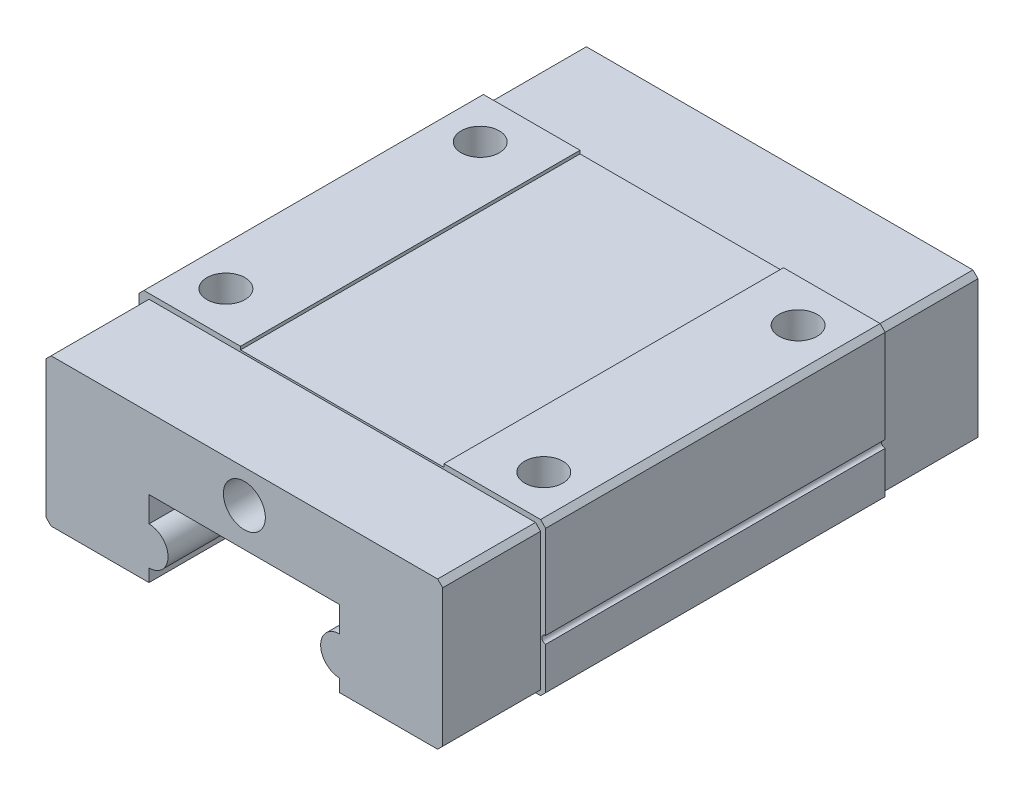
ISO-10303-21;
HEADER;
FILE_DESCRIPTION(('STEP AP214'),'2;1');
FILE_NAME('part.step','',(''),(''),'','','');
FILE_SCHEMA(('AUTOMOTIVE_DESIGN { 1 0 10303 214 1 1 1 1 }'));
ENDSEC;
DATA;
#1=APPLICATION_CONTEXT('core data for automotive mechanical design processes');
#2=APPLICATION_PROTOCOL_DEFINITION('international standard','automotive_design',2000,#1);
#3=PRODUCT_CONTEXT('',#1,'mechanical');
#4=PRODUCT('Part','Part','',(#3));
#5=PRODUCT_RELATED_PRODUCT_CATEGORY('part','',(#4));
#6=PRODUCT_DEFINITION_FORMATION('','',#4);
#7=PRODUCT_DEFINITION_CONTEXT('part definition',#1,'design');
#8=PRODUCT_DEFINITION('design','',#6,#7);
#9=PRODUCT_DEFINITION_SHAPE('','',#8);
#10=(LENGTH_UNIT() NAMED_UNIT(*) SI_UNIT(.MILLI.,.METRE.));
#11=(NAMED_UNIT(*) PLANE_ANGLE_UNIT() SI_UNIT($,.RADIAN.));
#12=(NAMED_UNIT(*) SI_UNIT($,.STERADIAN.) SOLID_ANGLE_UNIT());
#13=UNCERTAINTY_MEASURE_WITH_UNIT(LENGTH_MEASURE(1.E-05),#10,'distance_accuracy_value','');
#14=(GEOMETRIC_REPRESENTATION_CONTEXT(3) GLOBAL_UNCERTAINTY_ASSIGNED_CONTEXT((#13)) GLOBAL_UNIT_ASSIGNED_CONTEXT((#10,
#11,#12)) REPRESENTATION_CONTEXT('',''));
#15=CARTESIAN_POINT('',(0.,0.,0.));
#16=DIRECTION('',(0.,0.,1.));
#17=DIRECTION('',(1.,0.,0.));
#18=AXIS2_PLACEMENT_3D('',#15,#16,#17);
#19=CARTESIAN_POINT('',(-12.5,12.0000000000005,-10.));
#20=DIRECTION('',(0.,1.,0.));
#21=DIRECTION('',(-1.,0.,0.));
#22=AXIS2_PLACEMENT_3D('',#19,#20,#21);
#23=CONICAL_SURFACE('',#22,1.50000000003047,1.02974425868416);
#24=CARTESIAN_POINT('',(-12.5,11.0987090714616,-10.));
#25=VERTEX_POINT('',#24);
#26=VERTEX_LOOP('',#25);
#27=FACE_BOUND('',#26,.T.);
#28=CARTESIAN_POINT('',(-12.5,12.,-10.));
#29=DIRECTION('',(0.,-1.,0.));
#30=DIRECTION('',(0.,0.,-1.));
#31=AXIS2_PLACEMENT_3D('',#28,#29,#30);
#32=CIRCLE('',#31,1.5);
#33=CARTESIAN_POINT('',(-12.5,12.,-11.5));
#34=VERTEX_POINT('',#33);
#35=EDGE_CURVE('E424',#34,#34,#32,.F.);
#36=ORIENTED_EDGE('',*,*,#35,.T.);
#37=EDGE_LOOP('',(#36));
#38=FACE_BOUND('',#37,.T.);
#39=ADVANCED_FACE('F16',(#27,#38),#23,.F.);
#40=CARTESIAN_POINT('',(-12.5,12.0000000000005,10.));
#41=DIRECTION('',(0.,1.,0.));
#42=DIRECTION('',(-1.,0.,0.));
#43=AXIS2_PLACEMENT_3D('',#40,#41,#42);
#44=CONICAL_SURFACE('',#43,1.50000000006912,1.02974425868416);
#45=CARTESIAN_POINT('',(-12.5,11.0987090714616,10.));
#46=VERTEX_POINT('',#45);
#47=VERTEX_LOOP('',#46);
#48=FACE_BOUND('',#47,.T.);
#49=CARTESIAN_POINT('',(-12.5,12.,10.));
#50=DIRECTION('',(0.,-1.,0.));
#51=DIRECTION('',(0.,0.,-1.));
#52=AXIS2_PLACEMENT_3D('',#49,#50,#51);
#53=CIRCLE('',#52,1.5);
#54=CARTESIAN_POINT('',(-12.5,12.,8.5));
#55=VERTEX_POINT('',#54);
#56=EDGE_CURVE('E397',#55,#55,#53,.F.);
#57=ORIENTED_EDGE('',*,*,#56,.T.);
#58=EDGE_LOOP('',(#57));
#59=FACE_BOUND('',#58,.T.);
#60=ADVANCED_FACE('F944',(#48,#59),#44,.F.);
#61=CARTESIAN_POINT('',(12.5,12.0000000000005,-10.));
#62=DIRECTION('',(0.,1.,0.));
#63=DIRECTION('',(-1.,0.,0.));
#64=AXIS2_PLACEMENT_3D('',#61,#62,#63);
#65=CONICAL_SURFACE('',#64,1.50000000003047,1.02974425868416);
#66=CARTESIAN_POINT('',(12.5,11.0987090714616,-10.));
#67=VERTEX_POINT('',#66);
#68=VERTEX_LOOP('',#67);
#69=FACE_BOUND('',#68,.T.);
#70=CARTESIAN_POINT('',(12.5,12.,-10.));
#71=DIRECTION('',(0.,-1.,0.));
#72=DIRECTION('',(0.,0.,-1.));
#73=AXIS2_PLACEMENT_3D('',#70,#71,#72);
#74=CIRCLE('',#73,1.5);
#75=CARTESIAN_POINT('',(12.5,12.,-11.5));
#76=VERTEX_POINT('',#75);
#77=EDGE_CURVE('E389',#76,#76,#74,.F.);
#78=ORIENTED_EDGE('',*,*,#77,.T.);
#79=EDGE_LOOP('',(#78));
#80=FACE_BOUND('',#79,.T.);
#81=ADVANCED_FACE('F941',(#69,#80),#65,.F.);
#82=CARTESIAN_POINT('',(12.5,12.0000000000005,10.));
#83=DIRECTION('',(0.,1.,0.));
#84=DIRECTION('',(-1.,0.,0.));
#85=AXIS2_PLACEMENT_3D('',#82,#83,#84);
#86=CONICAL_SURFACE('',#85,1.50000000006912,1.02974425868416);
#87=CARTESIAN_POINT('',(12.5,11.0987090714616,10.));
#88=VERTEX_POINT('',#87);
#89=VERTEX_LOOP('',#88);
#90=FACE_BOUND('',#89,.T.);
#91=CARTESIAN_POINT('',(12.5,12.,10.));
#92=DIRECTION('',(0.,-1.,0.));
#93=DIRECTION('',(0.,0.,-1.));
#94=AXIS2_PLACEMENT_3D('',#91,#92,#93);
#95=CIRCLE('',#94,1.5);
#96=CARTESIAN_POINT('',(12.5,12.,8.5));
#97=VERTEX_POINT('',#96);
#98=EDGE_CURVE('E386',#97,#97,#95,.F.);
#99=ORIENTED_EDGE('',*,*,#98,.T.);
#100=EDGE_LOOP('',(#99));
#101=FACE_BOUND('',#100,.T.);
#102=ADVANCED_FACE('F943',(#90,#101),#86,.F.);
#103=CARTESIAN_POINT('',(-12.5,16.,-10.));
#104=DIRECTION('',(0.,-1.,0.));
#105=DIRECTION('',(0.,0.,-1.));
#106=AXIS2_PLACEMENT_3D('',#103,#104,#105);
#107=CYLINDRICAL_SURFACE('',#106,1.5);
#108=CARTESIAN_POINT('',(-12.5,16.,-10.));
#109=DIRECTION('',(0.,-1.,0.));
#110=DIRECTION('',(0.,0.,-1.));
#111=AXIS2_PLACEMENT_3D('',#108,#109,#110);
#112=CIRCLE('',#111,1.5);
#113=CARTESIAN_POINT('',(-12.5,16.,-11.5));
#114=VERTEX_POINT('',#113);
#115=EDGE_CURVE('E360',#114,#114,#112,.T.);
#116=ORIENTED_EDGE('',*,*,#115,.F.);
#117=EDGE_LOOP('',(#116));
#118=FACE_BOUND('',#117,.T.);
#119=ORIENTED_EDGE('',*,*,#35,.F.);
#120=EDGE_LOOP('',(#119));
#121=FACE_BOUND('',#120,.T.);
#122=ADVANCED_FACE('F952',(#118,#121),#107,.F.);
#123=CARTESIAN_POINT('',(-12.5,16.,10.));
#124=DIRECTION('',(0.,-1.,0.));
#125=DIRECTION('',(0.,0.,-1.));
#126=AXIS2_PLACEMENT_3D('',#123,#124,#125);
#127=CYLINDRICAL_SURFACE('',#126,1.5);
#128=CARTESIAN_POINT('',(-12.5,16.,10.));
#129=DIRECTION('',(0.,-1.,0.));
#130=DIRECTION('',(0.,0.,-1.));
#131=AXIS2_PLACEMENT_3D('',#128,#129,#130);
#132=CIRCLE('',#131,1.5);
#133=CARTESIAN_POINT('',(-12.5,16.,8.5));
#134=VERTEX_POINT('',#133);
#135=EDGE_CURVE('E356',#134,#134,#132,.T.);
#136=ORIENTED_EDGE('',*,*,#135,.F.);
#137=EDGE_LOOP('',(#136));
#138=FACE_BOUND('',#137,.T.);
#139=ORIENTED_EDGE('',*,*,#56,.F.);
#140=EDGE_LOOP('',(#139));
#141=FACE_BOUND('',#140,.T.);
#142=ADVANCED_FACE('F825',(#138,#141),#127,.F.);
#143=CARTESIAN_POINT('',(-8.,16.,13.35));
#144=DIRECTION('',(-1.,0.,0.));
#145=DIRECTION('',(0.,0.,1.));
#146=AXIS2_PLACEMENT_3D('',#143,#144,#145);
#147=PLANE('',#146);
#148=DIRECTION('',(0.,0.,1.));
#149=VECTOR('',#148,1.);
#150=CARTESIAN_POINT('',(-8.,16.,21.05));
#151=LINE('',#150,#149);
#152=CARTESIAN_POINT('',(-8.,16.,13.35));
#153=VERTEX_POINT('',#152);
#154=CARTESIAN_POINT('',(-8.,16.,-13.35));
#155=VERTEX_POINT('',#154);
#156=EDGE_CURVE('E357',#153,#155,#151,.F.);
#157=ORIENTED_EDGE('',*,*,#156,.F.);
#158=DIRECTION('',(0.,1.,0.));
#159=VECTOR('',#158,1.);
#160=CARTESIAN_POINT('',(-8.,16.,13.35));
#161=LINE('',#160,#159);
#162=CARTESIAN_POINT('',(-8.,15.75,13.35));
#163=VERTEX_POINT('',#162);
#164=EDGE_CURVE('E395',#163,#153,#161,.T.);
#165=ORIENTED_EDGE('',*,*,#164,.F.);
#166=DIRECTION('',(0.,0.,1.));
#167=VECTOR('',#166,1.);
#168=CARTESIAN_POINT('',(-8.,15.75,13.35));
#169=LINE('',#168,#167);
#170=CARTESIAN_POINT('',(-8.,15.75,-13.35));
#171=VERTEX_POINT('',#170);
#172=EDGE_CURVE('E353',#171,#163,#169,.T.);
#173=ORIENTED_EDGE('',*,*,#172,.F.);
#174=DIRECTION('',(0.,1.,0.));
#175=VECTOR('',#174,1.);
#176=CARTESIAN_POINT('',(-8.,16.,-13.35));
#177=LINE('',#176,#175);
#178=EDGE_CURVE('E392',#155,#171,#177,.F.);
#179=ORIENTED_EDGE('',*,*,#178,.F.);
#180=EDGE_LOOP('',(#157,#165,#173,#179));
#181=FACE_BOUND('',#180,.T.);
#182=ADVANCED_FACE('F800',(#181),#147,.F.);
#183=CARTESIAN_POINT('',(15.6,16.,21.05));
#184=DIRECTION('',(-0.707106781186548,-0.707106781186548,0.));
#185=DIRECTION('',(0.707106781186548,-0.707106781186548,0.));
#186=AXIS2_PLACEMENT_3D('',#183,#184,#185);
#187=PLANE('',#186);
#188=DIRECTION('',(0.707106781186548,-0.707106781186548,0.));
#189=VECTOR('',#188,1.);
#190=CARTESIAN_POINT('',(15.6,16.,-13.35));
#191=LINE('',#190,#189);
#192=CARTESIAN_POINT('',(15.6,16.,-13.35));
#193=VERTEX_POINT('',#192);
#194=CARTESIAN_POINT('',(16.,15.6,-13.35));
#195=VERTEX_POINT('',#194);
#196=EDGE_CURVE('E247',#193,#195,#191,.T.);
#197=ORIENTED_EDGE('',*,*,#196,.F.);
#198=DIRECTION('',(0.,0.,1.));
#199=VECTOR('',#198,1.);
#200=CARTESIAN_POINT('',(15.6,16.,21.05));
#201=LINE('',#200,#199);
#202=CARTESIAN_POINT('',(15.6,16.,13.35));
#203=VERTEX_POINT('',#202);
#204=EDGE_CURVE('E349',#203,#193,#201,.F.);
#205=ORIENTED_EDGE('',*,*,#204,.F.);
#206=DIRECTION('',(0.707106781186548,-0.707106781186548,0.));
#207=VECTOR('',#206,1.);
#208=CARTESIAN_POINT('',(15.6,16.,13.35));
#209=LINE('',#208,#207);
#210=CARTESIAN_POINT('',(16.,15.6,13.35));
#211=VERTEX_POINT('',#210);
#212=EDGE_CURVE('E394',#211,#203,#209,.F.);
#213=ORIENTED_EDGE('',*,*,#212,.F.);
#214=DIRECTION('',(0.,0.,-1.));
#215=VECTOR('',#214,1.);
#216=CARTESIAN_POINT('',(16.,15.6,21.05));
#217=LINE('',#216,#215);
#218=EDGE_CURVE('E243',#195,#211,#217,.F.);
#219=ORIENTED_EDGE('',*,*,#218,.F.);
#220=EDGE_LOOP('',(#197,#205,#213,#219));
#221=FACE_BOUND('',#220,.T.);
#222=ADVANCED_FACE('F814',(#221),#187,.F.);
#223=CARTESIAN_POINT('',(8.,16.,13.35));
#224=DIRECTION('',(-1.,0.,0.));
#225=DIRECTION('',(0.,0.,1.));
#226=AXIS2_PLACEMENT_3D('',#223,#224,#225);
#227=PLANE('',#226);
#228=DIRECTION('',(0.,1.,0.));
#229=VECTOR('',#228,1.);
#230=CARTESIAN_POINT('',(8.,16.,-13.35));
#231=LINE('',#230,#229);
#232=CARTESIAN_POINT('',(8.,16.,-13.35));
#233=VERTEX_POINT('',#232);
#234=CARTESIAN_POINT('',(8.,15.75,-13.35));
#235=VERTEX_POINT('',#234);
#236=EDGE_CURVE('E387',#233,#235,#231,.F.);
#237=ORIENTED_EDGE('',*,*,#236,.T.);
#238=DIRECTION('',(0.,0.,1.));
#239=VECTOR('',#238,1.);
#240=CARTESIAN_POINT('',(8.,15.75,13.35));
#241=LINE('',#240,#239);
#242=CARTESIAN_POINT('',(8.,15.75,13.35));
#243=VERTEX_POINT('',#242);
#244=EDGE_CURVE('E350',#243,#235,#241,.F.);
#245=ORIENTED_EDGE('',*,*,#244,.F.);
#246=DIRECTION('',(0.,1.,0.));
#247=VECTOR('',#246,1.);
#248=CARTESIAN_POINT('',(8.,16.,13.35));
#249=LINE('',#248,#247);
#250=CARTESIAN_POINT('',(8.,16.,13.35));
#251=VERTEX_POINT('',#250);
#252=EDGE_CURVE('E390',#243,#251,#249,.T.);
#253=ORIENTED_EDGE('',*,*,#252,.T.);
#254=DIRECTION('',(0.,0.,1.));
#255=VECTOR('',#254,1.);
#256=CARTESIAN_POINT('',(8.,16.,21.05));
#257=LINE('',#256,#255);
#258=EDGE_CURVE('E345',#233,#251,#257,.T.);
#259=ORIENTED_EDGE('',*,*,#258,.F.);
#260=EDGE_LOOP('',(#237,#245,#253,#259));
#261=FACE_BOUND('',#260,.T.);
#262=ADVANCED_FACE('F806',(#261),#227,.T.);
#263=CARTESIAN_POINT('',(12.5,16.,-10.));
#264=DIRECTION('',(0.,-1.,0.));
#265=DIRECTION('',(0.,0.,-1.));
#266=AXIS2_PLACEMENT_3D('',#263,#264,#265);
#267=CYLINDRICAL_SURFACE('',#266,1.5);
#268=CARTESIAN_POINT('',(12.5,16.,-10.));
#269=DIRECTION('',(0.,-1.,0.));
#270=DIRECTION('',(0.,0.,-1.));
#271=AXIS2_PLACEMENT_3D('',#268,#269,#270);
#272=CIRCLE('',#271,1.5);
#273=CARTESIAN_POINT('',(12.5,16.,-11.5));
#274=VERTEX_POINT('',#273);
#275=EDGE_CURVE('E348',#274,#274,#272,.T.);
#276=ORIENTED_EDGE('',*,*,#275,.F.);
#277=EDGE_LOOP('',(#276));
#278=FACE_BOUND('',#277,.T.);
#279=ORIENTED_EDGE('',*,*,#77,.F.);
#280=EDGE_LOOP('',(#279));
#281=FACE_BOUND('',#280,.T.);
#282=ADVANCED_FACE('F823',(#278,#281),#267,.F.);
#283=CARTESIAN_POINT('',(12.5,16.,10.));
#284=DIRECTION('',(0.,-1.,0.));
#285=DIRECTION('',(0.,0.,-1.));
#286=AXIS2_PLACEMENT_3D('',#283,#284,#285);
#287=CYLINDRICAL_SURFACE('',#286,1.5);
#288=CARTESIAN_POINT('',(12.5,16.,10.));
#289=DIRECTION('',(0.,-1.,0.));
#290=DIRECTION('',(0.,0.,-1.));
#291=AXIS2_PLACEMENT_3D('',#288,#289,#290);
#292=CIRCLE('',#291,1.5);
#293=CARTESIAN_POINT('',(12.5,16.,8.5));
#294=VERTEX_POINT('',#293);
#295=EDGE_CURVE('E344',#294,#294,#292,.T.);
#296=ORIENTED_EDGE('',*,*,#295,.F.);
#297=EDGE_LOOP('',(#296));
#298=FACE_BOUND('',#297,.T.);
#299=ORIENTED_EDGE('',*,*,#98,.F.);
#300=EDGE_LOOP('',(#299));
#301=FACE_BOUND('',#300,.T.);
#302=ADVANCED_FACE('F928',(#298,#301),#287,.F.);
#303=CARTESIAN_POINT('',(-16.,15.6,21.05));
#304=DIRECTION('',(0.707106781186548,-0.707106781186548,0.));
#305=DIRECTION('',(0.707106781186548,0.707106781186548,0.));
#306=AXIS2_PLACEMENT_3D('',#303,#304,#305);
#307=PLANE('',#306);
#308=DIRECTION('',(0.707106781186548,0.707106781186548,0.));
#309=VECTOR('',#308,1.);
#310=CARTESIAN_POINT('',(-16.,15.6,-13.35));
#311=LINE('',#310,#309);
#312=CARTESIAN_POINT('',(-16.,15.6,-13.35));
#313=VERTEX_POINT('',#312);
#314=CARTESIAN_POINT('',(-15.6,16.,-13.35));
#315=VERTEX_POINT('',#314);
#316=EDGE_CURVE('E234',#313,#315,#311,.T.);
#317=ORIENTED_EDGE('',*,*,#316,.F.);
#318=DIRECTION('',(0.,0.,1.));
#319=VECTOR('',#318,1.);
#320=CARTESIAN_POINT('',(-16.,15.6,21.05));
#321=LINE('',#320,#319);
#322=CARTESIAN_POINT('',(-16.,15.6,13.35));
#323=VERTEX_POINT('',#322);
#324=EDGE_CURVE('E341',#323,#313,#321,.F.);
#325=ORIENTED_EDGE('',*,*,#324,.F.);
#326=DIRECTION('',(0.707106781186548,0.707106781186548,0.));
#327=VECTOR('',#326,1.);
#328=CARTESIAN_POINT('',(-16.,15.6,13.35));
#329=LINE('',#328,#327);
#330=CARTESIAN_POINT('',(-15.6,16.,13.35));
#331=VERTEX_POINT('',#330);
#332=EDGE_CURVE('E384',#331,#323,#329,.F.);
#333=ORIENTED_EDGE('',*,*,#332,.F.);
#334=DIRECTION('',(0.,0.,1.));
#335=VECTOR('',#334,1.);
#336=CARTESIAN_POINT('',(-15.6,16.,21.05));
#337=LINE('',#336,#335);
#338=EDGE_CURVE('E242',#315,#331,#337,.T.);
#339=ORIENTED_EDGE('',*,*,#338,.F.);
#340=EDGE_LOOP('',(#317,#325,#333,#339));
#341=FACE_BOUND('',#340,.T.);
#342=ADVANCED_FACE('F791',(#341),#307,.F.);
#343=CARTESIAN_POINT('',(16.,8.,21.05));
#344=DIRECTION('',(0.,0.,-1.));
#345=DIRECTION('',(-1.,0.,0.));
#346=AXIS2_PLACEMENT_3D('',#343,#344,#345);
#347=CYLINDRICAL_SURFACE('',#346,0.3);
#348=CARTESIAN_POINT('',(16.,8.,13.35));
#349=DIRECTION('',(0.,0.,-1.));
#350=DIRECTION('',(-1.,0.,0.));
#351=AXIS2_PLACEMENT_3D('',#348,#349,#350);
#352=CIRCLE('',#351,0.3);
#353=CARTESIAN_POINT('',(16.,7.7,13.35));
#354=VERTEX_POINT('',#353);
#355=CARTESIAN_POINT('',(16.,8.3,13.35));
#356=VERTEX_POINT('',#355);
#357=EDGE_CURVE('E233',#354,#356,#352,.T.);
#358=ORIENTED_EDGE('',*,*,#357,.F.);
#359=DIRECTION('',(0.,0.,-1.));
#360=VECTOR('',#359,1.);
#361=CARTESIAN_POINT('',(16.,7.7,21.05));
#362=LINE('',#361,#360);
#363=CARTESIAN_POINT('',(16.,7.7,-13.35));
#364=VERTEX_POINT('',#363);
#365=EDGE_CURVE('E231',#364,#354,#362,.F.);
#366=ORIENTED_EDGE('',*,*,#365,.F.);
#367=CARTESIAN_POINT('',(16.,8.,-13.35));
#368=DIRECTION('',(0.,0.,-1.));
#369=DIRECTION('',(-1.,0.,0.));
#370=AXIS2_PLACEMENT_3D('',#367,#368,#369);
#371=CIRCLE('',#370,0.3);
#372=CARTESIAN_POINT('',(16.,8.3,-13.35));
#373=VERTEX_POINT('',#372);
#374=EDGE_CURVE('E19',#373,#364,#371,.F.);
#375=ORIENTED_EDGE('',*,*,#374,.F.);
#376=DIRECTION('',(0.,0.,-1.));
#377=VECTOR('',#376,1.);
#378=CARTESIAN_POINT('',(16.,8.3,21.05));
#379=LINE('',#378,#377);
#380=EDGE_CURVE('E228',#356,#373,#379,.T.);
#381=ORIENTED_EDGE('',*,*,#380,.F.);
#382=EDGE_LOOP('',(#358,#366,#375,#381));
#383=FACE_BOUND('',#382,.T.);
#384=ADVANCED_FACE('F227',(#383),#347,.F.);
#385=CARTESIAN_POINT('',(16.,16.,21.05));
#386=DIRECTION('',(1.,0.,0.));
#387=DIRECTION('',(0.,0.,-1.));
#388=AXIS2_PLACEMENT_3D('',#385,#386,#387);
#389=PLANE('',#388);
#390=ORIENTED_EDGE('',*,*,#380,.T.);
#391=DIRECTION('',(0.,1.,0.));
#392=VECTOR('',#391,1.);
#393=CARTESIAN_POINT('',(16.,16.,-13.35));
#394=LINE('',#393,#392);
#395=EDGE_CURVE('E239',#195,#373,#394,.F.);
#396=ORIENTED_EDGE('',*,*,#395,.F.);
#397=ORIENTED_EDGE('',*,*,#218,.T.);
#398=DIRECTION('',(0.,1.,0.));
#399=VECTOR('',#398,1.);
#400=CARTESIAN_POINT('',(16.,16.,13.35));
#401=LINE('',#400,#399);
#402=EDGE_CURVE('E241',#356,#211,#401,.T.);
#403=ORIENTED_EDGE('',*,*,#402,.F.);
#404=EDGE_LOOP('',(#390,#396,#397,#403));
#405=FACE_BOUND('',#404,.T.);
#406=ADVANCED_FACE('F237',(#405),#389,.T.);
#407=CARTESIAN_POINT('',(-16.,16.,21.05));
#408=DIRECTION('',(0.,1.,0.));
#409=DIRECTION('',(0.,0.,1.));
#410=AXIS2_PLACEMENT_3D('',#407,#408,#409);
#411=PLANE('',#410);
#412=ORIENTED_EDGE('',*,*,#135,.T.);
#413=EDGE_LOOP('',(#412));
#414=FACE_BOUND('',#413,.T.);
#415=ORIENTED_EDGE('',*,*,#115,.T.);
#416=EDGE_LOOP('',(#415));
#417=FACE_BOUND('',#416,.T.);
#418=ORIENTED_EDGE('',*,*,#156,.T.);
#419=DIRECTION('',(-1.,0.,0.));
#420=VECTOR('',#419,1.);
#421=CARTESIAN_POINT('',(16.,16.,-13.35));
#422=LINE('',#421,#420);
#423=EDGE_CURVE('E618',#315,#155,#422,.F.);
#424=ORIENTED_EDGE('',*,*,#423,.F.);
#425=ORIENTED_EDGE('',*,*,#338,.T.);
#426=DIRECTION('',(1.,0.,0.));
#427=VECTOR('',#426,1.);
#428=CARTESIAN_POINT('',(-16.,16.,13.35));
#429=LINE('',#428,#427);
#430=EDGE_CURVE('E286',#153,#331,#429,.F.);
#431=ORIENTED_EDGE('',*,*,#430,.F.);
#432=EDGE_LOOP('',(#418,#424,#425,#431));
#433=FACE_BOUND('',#432,.T.);
#434=ADVANCED_FACE('F795',(#414,#417,#433),#411,.T.);
#435=CARTESIAN_POINT('',(-16.,15.75,13.35));
#436=DIRECTION('',(0.,1.,0.));
#437=DIRECTION('',(0.,0.,1.));
#438=AXIS2_PLACEMENT_3D('',#435,#436,#437);
#439=PLANE('',#438);
#440=ORIENTED_EDGE('',*,*,#244,.T.);
#441=DIRECTION('',(-1.,0.,0.));
#442=VECTOR('',#441,1.);
#443=CARTESIAN_POINT('',(16.,15.75,-13.35));
#444=LINE('',#443,#442);
#445=EDGE_CURVE('E415',#171,#235,#444,.F.);
#446=ORIENTED_EDGE('',*,*,#445,.F.);
#447=ORIENTED_EDGE('',*,*,#172,.T.);
#448=DIRECTION('',(1.,0.,0.));
#449=VECTOR('',#448,1.);
#450=CARTESIAN_POINT('',(-16.,15.75,13.35));
#451=LINE('',#450,#449);
#452=EDGE_CURVE('E289',#243,#163,#451,.F.);
#453=ORIENTED_EDGE('',*,*,#452,.F.);
#454=EDGE_LOOP('',(#440,#446,#447,#453));
#455=FACE_BOUND('',#454,.T.);
#456=ADVANCED_FACE('F803',(#455),#439,.T.);
#457=CARTESIAN_POINT('',(-16.,16.,21.05));
#458=DIRECTION('',(0.,1.,0.));
#459=DIRECTION('',(0.,0.,1.));
#460=AXIS2_PLACEMENT_3D('',#457,#458,#459);
#461=PLANE('',#460);
#462=ORIENTED_EDGE('',*,*,#295,.T.);
#463=EDGE_LOOP('',(#462));
#464=FACE_BOUND('',#463,.T.);
#465=ORIENTED_EDGE('',*,*,#275,.T.);
#466=EDGE_LOOP('',(#465));
#467=FACE_BOUND('',#466,.T.);
#468=ORIENTED_EDGE('',*,*,#258,.T.);
#469=DIRECTION('',(1.,0.,0.));
#470=VECTOR('',#469,1.);
#471=CARTESIAN_POINT('',(-16.,16.,13.35));
#472=LINE('',#471,#470);
#473=EDGE_CURVE('E292',#203,#251,#472,.F.);
#474=ORIENTED_EDGE('',*,*,#473,.F.);
#475=ORIENTED_EDGE('',*,*,#204,.T.);
#476=DIRECTION('',(-1.,0.,0.));
#477=VECTOR('',#476,1.);
#478=CARTESIAN_POINT('',(16.,16.,-13.35));
#479=LINE('',#478,#477);
#480=EDGE_CURVE('E412',#233,#193,#479,.F.);
#481=ORIENTED_EDGE('',*,*,#480,.F.);
#482=EDGE_LOOP('',(#468,#474,#475,#481));
#483=FACE_BOUND('',#482,.T.);
#484=ADVANCED_FACE('F810',(#464,#467,#483),#461,.T.);
#485=CARTESIAN_POINT('',(-16.,4.,21.05));
#486=DIRECTION('',(-1.,0.,0.));
#487=DIRECTION('',(0.,0.,1.));
#488=AXIS2_PLACEMENT_3D('',#485,#486,#487);
#489=PLANE('',#488);
#490=ORIENTED_EDGE('',*,*,#324,.T.);
#491=DIRECTION('',(0.,1.,0.));
#492=VECTOR('',#491,1.);
#493=CARTESIAN_POINT('',(-16.,16.,-13.35));
#494=LINE('',#493,#492);
#495=CARTESIAN_POINT('',(-16.,4.4,-13.35));
#496=VERTEX_POINT('',#495);
#497=EDGE_CURVE('E621',#496,#313,#494,.T.);
#498=ORIENTED_EDGE('',*,*,#497,.F.);
#499=DIRECTION('',(0.,0.,1.));
#500=VECTOR('',#499,1.);
#501=CARTESIAN_POINT('',(-16.,4.4,21.05));
#502=LINE('',#501,#500);
#503=CARTESIAN_POINT('',(-16.,4.4,13.35));
#504=VERTEX_POINT('',#503);
#505=EDGE_CURVE('E598',#496,#504,#502,.T.);
#506=ORIENTED_EDGE('',*,*,#505,.T.);
#507=DIRECTION('',(0.,1.,0.));
#508=VECTOR('',#507,1.);
#509=CARTESIAN_POINT('',(-16.,16.,13.35));
#510=LINE('',#509,#508);
#511=EDGE_CURVE('E284',#323,#504,#510,.F.);
#512=ORIENTED_EDGE('',*,*,#511,.F.);
#513=EDGE_LOOP('',(#490,#498,#506,#512));
#514=FACE_BOUND('',#513,.T.);
#515=ADVANCED_FACE('F788',(#514),#489,.T.);
#516=CARTESIAN_POINT('',(16.,7.7,21.05));
#517=DIRECTION('',(1.,0.,0.));
#518=DIRECTION('',(0.,0.,-1.));
#519=AXIS2_PLACEMENT_3D('',#516,#517,#518);
#520=PLANE('',#519);
#521=ORIENTED_EDGE('',*,*,#365,.T.);
#522=DIRECTION('',(0.,1.,0.));
#523=VECTOR('',#522,1.);
#524=CARTESIAN_POINT('',(16.,16.,13.35));
#525=LINE('',#524,#523);
#526=CARTESIAN_POINT('',(16.,4.4,13.35));
#527=VERTEX_POINT('',#526);
#528=EDGE_CURVE('E267',#527,#354,#525,.T.);
#529=ORIENTED_EDGE('',*,*,#528,.F.);
#530=DIRECTION('',(0.,0.,1.));
#531=VECTOR('',#530,1.);
#532=CARTESIAN_POINT('',(16.,4.4,21.05));
#533=LINE('',#532,#531);
#534=CARTESIAN_POINT('',(16.,4.4,-13.35));
#535=VERTEX_POINT('',#534);
#536=EDGE_CURVE('E364',#527,#535,#533,.F.);
#537=ORIENTED_EDGE('',*,*,#536,.T.);
#538=DIRECTION('',(0.,1.,0.));
#539=VECTOR('',#538,1.);
#540=CARTESIAN_POINT('',(16.,16.,-13.35));
#541=LINE('',#540,#539);
#542=EDGE_CURVE('E249',#364,#535,#541,.F.);
#543=ORIENTED_EDGE('',*,*,#542,.F.);
#544=EDGE_LOOP('',(#521,#529,#537,#543));
#545=FACE_BOUND('',#544,.T.);
#546=ADVANCED_FACE('F451',(#545),#520,.T.);
#547=CARTESIAN_POINT('',(15.2,15.6,21.05));
#548=DIRECTION('',(0.707106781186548,0.707106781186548,0.));
#549=DIRECTION('',(-0.707106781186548,0.707106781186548,0.));
#550=AXIS2_PLACEMENT_3D('',#547,#548,#549);
#551=PLANE('',#550);
#552=DIRECTION('',(0.,0.,1.));
#553=VECTOR('',#552,1.);
#554=CARTESIAN_POINT('',(15.2,15.6,21.05));
#555=LINE('',#554,#553);
#556=CARTESIAN_POINT('',(15.2,15.6,21.05));
#557=VERTEX_POINT('',#556);
#558=CARTESIAN_POINT('',(15.2,15.6,13.35));
#559=VERTEX_POINT('',#558);
#560=EDGE_CURVE('E554',#557,#559,#555,.F.);
#561=ORIENTED_EDGE('',*,*,#560,.F.);
#562=DIRECTION('',(-0.707106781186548,0.707106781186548,0.));
#563=VECTOR('',#562,1.);
#564=CARTESIAN_POINT('',(15.2,15.6,21.05));
#565=LINE('',#564,#563);
#566=CARTESIAN_POINT('',(15.6,15.2,21.05));
#567=VERTEX_POINT('',#566);
#568=EDGE_CURVE('E296',#557,#567,#565,.F.);
#569=ORIENTED_EDGE('',*,*,#568,.T.);
#570=DIRECTION('',(0.,0.,1.));
#571=VECTOR('',#570,1.);
#572=CARTESIAN_POINT('',(15.6,15.2,21.05));
#573=LINE('',#572,#571);
#574=CARTESIAN_POINT('',(15.6,15.2,13.35));
#575=VERTEX_POINT('',#574);
#576=EDGE_CURVE('E562',#567,#575,#573,.F.);
#577=ORIENTED_EDGE('',*,*,#576,.T.);
#578=DIRECTION('',(0.707106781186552,-0.707106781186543,0.));
#579=VECTOR('',#578,1.);
#580=CARTESIAN_POINT('',(15.2,15.6,13.35));
#581=LINE('',#580,#579);
#582=EDGE_CURVE('E277',#559,#575,#581,.T.);
#583=ORIENTED_EDGE('',*,*,#582,.F.);
#584=EDGE_LOOP('',(#561,#569,#577,#583));
#585=FACE_BOUND('',#584,.T.);
#586=ADVANCED_FACE('F761',(#585),#551,.T.);
#587=CARTESIAN_POINT('',(-15.6,15.2,21.05));
#588=DIRECTION('',(0.707106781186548,-0.707106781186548,0.));
#589=DIRECTION('',(0.707106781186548,0.707106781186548,0.));
#590=AXIS2_PLACEMENT_3D('',#587,#588,#589);
#591=PLANE('',#590);
#592=DIRECTION('',(0.707106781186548,0.707106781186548,0.));
#593=VECTOR('',#592,1.);
#594=CARTESIAN_POINT('',(-15.6,15.2,13.35));
#595=LINE('',#594,#593);
#596=CARTESIAN_POINT('',(-15.6,15.2,13.35));
#597=VERTEX_POINT('',#596);
#598=CARTESIAN_POINT('',(-15.2,15.6,13.35));
#599=VERTEX_POINT('',#598);
#600=EDGE_CURVE('E280',#597,#599,#595,.T.);
#601=ORIENTED_EDGE('',*,*,#600,.F.);
#602=DIRECTION('',(0.,0.,1.));
#603=VECTOR('',#602,1.);
#604=CARTESIAN_POINT('',(-15.6,15.2,21.05));
#605=LINE('',#604,#603);
#606=CARTESIAN_POINT('',(-15.6,15.2,21.05));
#607=VERTEX_POINT('',#606);
#608=EDGE_CURVE('E545',#607,#597,#605,.F.);
#609=ORIENTED_EDGE('',*,*,#608,.F.);
#610=DIRECTION('',(0.707106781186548,0.707106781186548,0.));
#611=VECTOR('',#610,1.);
#612=CARTESIAN_POINT('',(-15.6,15.2,21.05));
#613=LINE('',#612,#611);
#614=CARTESIAN_POINT('',(-15.2,15.6,21.05));
#615=VERTEX_POINT('',#614);
#616=EDGE_CURVE('E293',#615,#607,#613,.F.);
#617=ORIENTED_EDGE('',*,*,#616,.F.);
#618=DIRECTION('',(0.,0.,1.));
#619=VECTOR('',#618,1.);
#620=CARTESIAN_POINT('',(-15.2,15.6,21.05));
#621=LINE('',#620,#619);
#622=EDGE_CURVE('E548',#599,#615,#621,.T.);
#623=ORIENTED_EDGE('',*,*,#622,.F.);
#624=EDGE_LOOP('',(#601,#609,#617,#623));
#625=FACE_BOUND('',#624,.T.);
#626=ADVANCED_FACE('F771',(#625),#591,.F.);
#627=CARTESIAN_POINT('',(-16.,16.,13.35));
#628=DIRECTION('',(0.,0.,1.));
#629=DIRECTION('',(1.,0.,0.));
#630=AXIS2_PLACEMENT_3D('',#627,#628,#629);
#631=PLANE('',#630);
#632=ORIENTED_EDGE('',*,*,#357,.T.);
#633=ORIENTED_EDGE('',*,*,#402,.T.);
#634=ORIENTED_EDGE('',*,*,#212,.T.);
#635=ORIENTED_EDGE('',*,*,#473,.T.);
#636=ORIENTED_EDGE('',*,*,#252,.F.);
#637=ORIENTED_EDGE('',*,*,#452,.T.);
#638=ORIENTED_EDGE('',*,*,#164,.T.);
#639=ORIENTED_EDGE('',*,*,#430,.T.);
#640=ORIENTED_EDGE('',*,*,#332,.T.);
#641=ORIENTED_EDGE('',*,*,#511,.T.);
#642=DIRECTION('',(-0.707106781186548,0.707106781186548,0.));
#643=VECTOR('',#642,1.);
#644=CARTESIAN_POINT('',(-15.6,4.,13.35));
#645=LINE('',#644,#643);
#646=CARTESIAN_POINT('',(-15.6,4.,13.35));
#647=VERTEX_POINT('',#646);
#648=EDGE_CURVE('E604',#504,#647,#645,.F.);
#649=ORIENTED_EDGE('',*,*,#648,.T.);
#650=DIRECTION('',(1.,0.,0.));
#651=VECTOR('',#650,1.);
#652=CARTESIAN_POINT('',(-16.,4.,13.35));
#653=LINE('',#652,#651);
#654=CARTESIAN_POINT('',(-15.2,4.,13.35));
#655=VERTEX_POINT('',#654);
#656=EDGE_CURVE('E282',#647,#655,#653,.T.);
#657=ORIENTED_EDGE('',*,*,#656,.T.);
#658=DIRECTION('',(-0.707106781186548,0.707106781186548,0.));
#659=VECTOR('',#658,1.);
#660=CARTESIAN_POINT('',(-15.2,4.,13.35));
#661=LINE('',#660,#659);
#662=CARTESIAN_POINT('',(-15.6,4.4,13.35));
#663=VERTEX_POINT('',#662);
#664=EDGE_CURVE('E607',#655,#663,#661,.T.);
#665=ORIENTED_EDGE('',*,*,#664,.T.);
#666=DIRECTION('',(0.,1.,0.));
#667=VECTOR('',#666,1.);
#668=CARTESIAN_POINT('',(-15.6,4.,13.35));
#669=LINE('',#668,#667);
#670=EDGE_CURVE('E542',#597,#663,#669,.F.);
#671=ORIENTED_EDGE('',*,*,#670,.F.);
#672=ORIENTED_EDGE('',*,*,#600,.T.);
#673=DIRECTION('',(1.,0.,0.));
#674=VECTOR('',#673,1.);
#675=CARTESIAN_POINT('',(-16.,15.6,13.35));
#676=LINE('',#675,#674);
#677=EDGE_CURVE('E551',#559,#599,#676,.F.);
#678=ORIENTED_EDGE('',*,*,#677,.F.);
#679=ORIENTED_EDGE('',*,*,#582,.T.);
#680=DIRECTION('',(0.,1.,0.));
#681=VECTOR('',#680,1.);
#682=CARTESIAN_POINT('',(15.6,4.,13.35));
#683=LINE('',#682,#681);
#684=CARTESIAN_POINT('',(15.6,4.4,13.35));
#685=VERTEX_POINT('',#684);
#686=EDGE_CURVE('E560',#575,#685,#683,.F.);
#687=ORIENTED_EDGE('',*,*,#686,.T.);
#688=DIRECTION('',(0.707106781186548,0.707106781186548,0.));
#689=VECTOR('',#688,1.);
#690=CARTESIAN_POINT('',(15.6,4.4,13.35));
#691=LINE('',#690,#689);
#692=CARTESIAN_POINT('',(15.2,4.,13.35));
#693=VERTEX_POINT('',#692);
#694=EDGE_CURVE('E372',#693,#685,#691,.T.);
#695=ORIENTED_EDGE('',*,*,#694,.F.);
#696=DIRECTION('',(1.,0.,0.));
#697=VECTOR('',#696,1.);
#698=CARTESIAN_POINT('',(-16.,4.,13.35));
#699=LINE('',#698,#697);
#700=CARTESIAN_POINT('',(15.6,4.,13.35));
#701=VERTEX_POINT('',#700);
#702=EDGE_CURVE('E272',#693,#701,#699,.T.);
#703=ORIENTED_EDGE('',*,*,#702,.T.);
#704=DIRECTION('',(-0.707106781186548,-0.707106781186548,0.));
#705=VECTOR('',#704,1.);
#706=CARTESIAN_POINT('',(16.,4.4,13.35));
#707=LINE('',#706,#705);
#708=EDGE_CURVE('E367',#701,#527,#707,.F.);
#709=ORIENTED_EDGE('',*,*,#708,.T.);
#710=ORIENTED_EDGE('',*,*,#528,.T.);
#711=EDGE_LOOP('',(#632,#633,#634,#635,#636,#637,#638,#639,#640,#641,#649,#657,#665,#671,#672,
#678,#679,#687,#695,#703,#709,#710));
#712=FACE_BOUND('',#711,.T.);
#713=ADVANCED_FACE('F449',(#712),#631,.T.);
#714=CARTESIAN_POINT('',(0.,13.,16.050000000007));
#715=DIRECTION('',(0.,0.,1.));
#716=DIRECTION('',(1.,0.,0.));
#717=AXIS2_PLACEMENT_3D('',#714,#715,#716);
#718=CONICAL_SURFACE('',#717,1.64999999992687,1.02974425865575);
#719=CARTESIAN_POINT('',(-5.6843418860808E-11,13.,15.0585799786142));
#720=VERTEX_POINT('',#719);
#721=VERTEX_LOOP('',#720);
#722=FACE_BOUND('',#721,.T.);
#723=CARTESIAN_POINT('',(0.,13.,16.05));
#724=DIRECTION('',(0.,0.,-1.));
#725=DIRECTION('',(-1.,0.,0.));
#726=AXIS2_PLACEMENT_3D('',#723,#724,#725);
#727=CIRCLE('',#726,1.65);
#728=CARTESIAN_POINT('',(-1.65,13.,16.05));
#729=VERTEX_POINT('',#728);
#730=EDGE_CURVE('E261',#729,#729,#727,.F.);
#731=ORIENTED_EDGE('',*,*,#730,.T.);
#732=EDGE_LOOP('',(#731));
#733=FACE_BOUND('',#732,.T.);
#734=ADVANCED_FACE('F900',(#722,#733),#718,.F.);
#735=CARTESIAN_POINT('',(15.6,15.2,-21.05));
#736=DIRECTION('',(-0.707106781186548,-0.707106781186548,0.));
#737=DIRECTION('',(0.707106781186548,-0.707106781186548,0.));
#738=AXIS2_PLACEMENT_3D('',#735,#736,#737);
#739=PLANE('',#738);
#740=DIRECTION('',(-0.707106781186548,0.707106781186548,0.));
#741=VECTOR('',#740,1.);
#742=CARTESIAN_POINT('',(15.6,15.2,-13.35));
#743=LINE('',#742,#741);
#744=CARTESIAN_POINT('',(15.6,15.2,-13.35));
#745=VERTEX_POINT('',#744);
#746=CARTESIAN_POINT('',(15.2,15.6,-13.35));
#747=VERTEX_POINT('',#746);
#748=EDGE_CURVE('E626',#745,#747,#743,.T.);
#749=ORIENTED_EDGE('',*,*,#748,.F.);
#750=DIRECTION('',(0.,0.,-1.));
#751=VECTOR('',#750,1.);
#752=CARTESIAN_POINT('',(15.6,15.2,-21.05));
#753=LINE('',#752,#751);
#754=CARTESIAN_POINT('',(15.6,15.2,-21.05));
#755=VERTEX_POINT('',#754);
#756=EDGE_CURVE('E527',#755,#745,#753,.F.);
#757=ORIENTED_EDGE('',*,*,#756,.F.);
#758=DIRECTION('',(0.707106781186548,-0.707106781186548,0.));
#759=VECTOR('',#758,1.);
#760=CARTESIAN_POINT('',(15.6,15.2,-21.05));
#761=LINE('',#760,#759);
#762=CARTESIAN_POINT('',(15.2,15.6,-21.05));
#763=VERTEX_POINT('',#762);
#764=EDGE_CURVE('E250',#763,#755,#761,.T.);
#765=ORIENTED_EDGE('',*,*,#764,.F.);
#766=DIRECTION('',(0.,0.,1.));
#767=VECTOR('',#766,1.);
#768=CARTESIAN_POINT('',(15.2,15.6,-21.05));
#769=LINE('',#768,#767);
#770=EDGE_CURVE('E521',#747,#763,#769,.F.);
#771=ORIENTED_EDGE('',*,*,#770,.F.);
#772=EDGE_LOOP('',(#749,#757,#765,#771));
#773=FACE_BOUND('',#772,.T.);
#774=ADVANCED_FACE('F897',(#773),#739,.F.);
#775=CARTESIAN_POINT('',(16.,16.,-13.35));
#776=DIRECTION('',(0.,0.,-1.));
#777=DIRECTION('',(-1.,0.,0.));
#778=AXIS2_PLACEMENT_3D('',#775,#776,#777);
#779=PLANE('',#778);
#780=ORIENTED_EDGE('',*,*,#236,.F.);
#781=ORIENTED_EDGE('',*,*,#480,.T.);
#782=ORIENTED_EDGE('',*,*,#196,.T.);
#783=ORIENTED_EDGE('',*,*,#395,.T.);
#784=ORIENTED_EDGE('',*,*,#374,.T.);
#785=ORIENTED_EDGE('',*,*,#542,.T.);
#786=DIRECTION('',(-0.707106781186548,-0.707106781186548,0.));
#787=VECTOR('',#786,1.);
#788=CARTESIAN_POINT('',(16.,4.4,-13.35));
#789=LINE('',#788,#787);
#790=CARTESIAN_POINT('',(15.6,4.,-13.35));
#791=VERTEX_POINT('',#790);
#792=EDGE_CURVE('E366',#535,#791,#789,.T.);
#793=ORIENTED_EDGE('',*,*,#792,.T.);
#794=DIRECTION('',(-1.,0.,0.));
#795=VECTOR('',#794,1.);
#796=CARTESIAN_POINT('',(16.,4.,-13.35));
#797=LINE('',#796,#795);
#798=CARTESIAN_POINT('',(15.2,4.,-13.35));
#799=VERTEX_POINT('',#798);
#800=EDGE_CURVE('E252',#791,#799,#797,.T.);
#801=ORIENTED_EDGE('',*,*,#800,.T.);
#802=DIRECTION('',(-0.707106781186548,-0.707106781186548,0.));
#803=VECTOR('',#802,1.);
#804=CARTESIAN_POINT('',(15.2,4.,-13.35));
#805=LINE('',#804,#803);
#806=CARTESIAN_POINT('',(15.6,4.4,-13.35));
#807=VERTEX_POINT('',#806);
#808=EDGE_CURVE('E380',#799,#807,#805,.F.);
#809=ORIENTED_EDGE('',*,*,#808,.T.);
#810=DIRECTION('',(0.,1.,0.));
#811=VECTOR('',#810,1.);
#812=CARTESIAN_POINT('',(15.6,4.,-13.35));
#813=LINE('',#812,#811);
#814=EDGE_CURVE('E524',#745,#807,#813,.F.);
#815=ORIENTED_EDGE('',*,*,#814,.F.);
#816=ORIENTED_EDGE('',*,*,#748,.T.);
#817=DIRECTION('',(1.,0.,0.));
#818=VECTOR('',#817,1.);
#819=CARTESIAN_POINT('',(16.,15.6,-13.35));
#820=LINE('',#819,#818);
#821=CARTESIAN_POINT('',(-15.2,15.6,-13.35));
#822=VERTEX_POINT('',#821);
#823=EDGE_CURVE('E515',#822,#747,#820,.T.);
#824=ORIENTED_EDGE('',*,*,#823,.F.);
#825=DIRECTION('',(0.707106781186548,0.707106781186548,0.));
#826=VECTOR('',#825,1.);
#827=CARTESIAN_POINT('',(-15.2,15.6,-13.35));
#828=LINE('',#827,#826);
#829=CARTESIAN_POINT('',(-15.6,15.2,-13.35));
#830=VERTEX_POINT('',#829);
#831=EDGE_CURVE('E612',#822,#830,#828,.F.);
#832=ORIENTED_EDGE('',*,*,#831,.T.);
#833=DIRECTION('',(0.,1.,0.));
#834=VECTOR('',#833,1.);
#835=CARTESIAN_POINT('',(-15.6,15.6,-13.35));
#836=LINE('',#835,#834);
#837=CARTESIAN_POINT('',(-15.6,4.4,-13.35));
#838=VERTEX_POINT('',#837);
#839=EDGE_CURVE('E509',#838,#830,#836,.T.);
#840=ORIENTED_EDGE('',*,*,#839,.F.);
#841=DIRECTION('',(-0.707106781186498,0.707106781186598,0.));
#842=VECTOR('',#841,1.);
#843=CARTESIAN_POINT('',(-15.6,4.4,-13.35));
#844=LINE('',#843,#842);
#845=CARTESIAN_POINT('',(-15.2,4.,-13.35));
#846=VERTEX_POINT('',#845);
#847=EDGE_CURVE('E586',#838,#846,#844,.F.);
#848=ORIENTED_EDGE('',*,*,#847,.T.);
#849=DIRECTION('',(-1.,0.,0.));
#850=VECTOR('',#849,1.);
#851=CARTESIAN_POINT('',(16.,4.,-13.35));
#852=LINE('',#851,#850);
#853=CARTESIAN_POINT('',(-15.6,4.,-13.35));
#854=VERTEX_POINT('',#853);
#855=EDGE_CURVE('E624',#846,#854,#852,.T.);
#856=ORIENTED_EDGE('',*,*,#855,.T.);
#857=DIRECTION('',(-0.707106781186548,0.707106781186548,0.));
#858=VECTOR('',#857,1.);
#859=CARTESIAN_POINT('',(-15.6,4.,-13.35));
#860=LINE('',#859,#858);
#861=EDGE_CURVE('E601',#854,#496,#860,.T.);
#862=ORIENTED_EDGE('',*,*,#861,.T.);
#863=ORIENTED_EDGE('',*,*,#497,.T.);
#864=ORIENTED_EDGE('',*,*,#316,.T.);
#865=ORIENTED_EDGE('',*,*,#423,.T.);
#866=ORIENTED_EDGE('',*,*,#178,.T.);
#867=ORIENTED_EDGE('',*,*,#445,.T.);
#868=EDGE_LOOP('',(#780,#781,#782,#783,#784,#785,#793,#801,#809,#815,#816,#824,#832,#840,#848,
#856,#862,#863,#864,#865,#866,#867));
#869=FACE_BOUND('',#868,.T.);
#870=ADVANCED_FACE('F245',(#869),#779,.T.);
#871=CARTESIAN_POINT('',(-15.2,15.6,-21.05));
#872=DIRECTION('',(0.707106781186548,-0.707106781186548,0.));
#873=DIRECTION('',(0.707106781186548,0.707106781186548,0.));
#874=AXIS2_PLACEMENT_3D('',#871,#872,#873);
#875=PLANE('',#874);
#876=ORIENTED_EDGE('',*,*,#831,.F.);
#877=DIRECTION('',(0.,0.,1.));
#878=VECTOR('',#877,1.);
#879=CARTESIAN_POINT('',(-15.2,15.6,-21.05));
#880=LINE('',#879,#878);
#881=CARTESIAN_POINT('',(-15.2,15.6,-21.05));
#882=VERTEX_POINT('',#881);
#883=EDGE_CURVE('E518',#882,#822,#880,.T.);
#884=ORIENTED_EDGE('',*,*,#883,.F.);
#885=DIRECTION('',(0.707106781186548,0.707106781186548,0.));
#886=VECTOR('',#885,1.);
#887=CARTESIAN_POINT('',(-15.2,15.6,-21.05));
#888=LINE('',#887,#886);
#889=CARTESIAN_POINT('',(-15.6,15.2,-21.05));
#890=VERTEX_POINT('',#889);
#891=EDGE_CURVE('E414',#890,#882,#888,.T.);
#892=ORIENTED_EDGE('',*,*,#891,.F.);
#893=DIRECTION('',(0.,0.,1.));
#894=VECTOR('',#893,1.);
#895=CARTESIAN_POINT('',(-15.6,15.2,-21.05));
#896=LINE('',#895,#894);
#897=EDGE_CURVE('E506',#830,#890,#896,.F.);
#898=ORIENTED_EDGE('',*,*,#897,.F.);
#899=EDGE_LOOP('',(#876,#884,#892,#898));
#900=FACE_BOUND('',#899,.T.);
#901=ADVANCED_FACE('F663',(#900),#875,.F.);
#902=CARTESIAN_POINT('',(-15.2,4.,21.05));
#903=DIRECTION('',(0.707106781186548,0.707106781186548,0.));
#904=DIRECTION('',(-0.707106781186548,0.707106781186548,0.));
#905=AXIS2_PLACEMENT_3D('',#902,#903,#904);
#906=PLANE('',#905);
#907=ORIENTED_EDGE('',*,*,#664,.F.);
#908=DIRECTION('',(0.,0.,-1.));
#909=VECTOR('',#908,1.);
#910=CARTESIAN_POINT('',(-15.2,4.,21.05));
#911=LINE('',#910,#909);
#912=CARTESIAN_POINT('',(-15.2,4.,21.05));
#913=VERTEX_POINT('',#912);
#914=EDGE_CURVE('E503',#913,#655,#911,.T.);
#915=ORIENTED_EDGE('',*,*,#914,.F.);
#916=DIRECTION('',(-0.707106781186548,0.707106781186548,0.));
#917=VECTOR('',#916,1.);
#918=CARTESIAN_POINT('',(-15.2,4.,21.05));
#919=LINE('',#918,#917);
#920=CARTESIAN_POINT('',(-15.6,4.4,21.05));
#921=VERTEX_POINT('',#920);
#922=EDGE_CURVE('E609',#921,#913,#919,.F.);
#923=ORIENTED_EDGE('',*,*,#922,.F.);
#924=DIRECTION('',(0.,0.,1.));
#925=VECTOR('',#924,1.);
#926=CARTESIAN_POINT('',(-15.6,4.4,21.05));
#927=LINE('',#926,#925);
#928=EDGE_CURVE('E265',#663,#921,#927,.T.);
#929=ORIENTED_EDGE('',*,*,#928,.F.);
#930=EDGE_LOOP('',(#907,#915,#923,#929));
#931=FACE_BOUND('',#930,.T.);
#932=ADVANCED_FACE('F777',(#931),#906,.F.);
#933=CARTESIAN_POINT('',(-15.6,4.,21.05));
#934=DIRECTION('',(0.707106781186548,0.707106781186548,0.));
#935=DIRECTION('',(-0.707106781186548,0.707106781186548,0.));
#936=AXIS2_PLACEMENT_3D('',#933,#934,#935);
#937=PLANE('',#936);
#938=ORIENTED_EDGE('',*,*,#861,.F.);
#939=DIRECTION('',(0.,0.,-1.));
#940=VECTOR('',#939,1.);
#941=CARTESIAN_POINT('',(-15.6,4.,21.05));
#942=LINE('',#941,#940);
#943=EDGE_CURVE('E500',#647,#854,#942,.T.);
#944=ORIENTED_EDGE('',*,*,#943,.F.);
#945=ORIENTED_EDGE('',*,*,#648,.F.);
#946=ORIENTED_EDGE('',*,*,#505,.F.);
#947=EDGE_LOOP('',(#938,#944,#945,#946));
#948=FACE_BOUND('',#947,.T.);
#949=ADVANCED_FACE('F785',(#948),#937,.F.);
#950=CARTESIAN_POINT('',(-15.6,4.4,-21.05));
#951=DIRECTION('',(0.707106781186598,0.707106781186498,0.));
#952=DIRECTION('',(-0.707106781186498,0.707106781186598,0.));
#953=AXIS2_PLACEMENT_3D('',#950,#951,#952);
#954=PLANE('',#953);
#955=ORIENTED_EDGE('',*,*,#847,.F.);
#956=DIRECTION('',(0.,0.,1.));
#957=VECTOR('',#956,1.);
#958=CARTESIAN_POINT('',(-15.6,4.4,-21.05));
#959=LINE('',#958,#957);
#960=CARTESIAN_POINT('',(-15.6,4.4,-21.05));
#961=VERTEX_POINT('',#960);
#962=EDGE_CURVE('E512',#961,#838,#959,.T.);
#963=ORIENTED_EDGE('',*,*,#962,.F.);
#964=DIRECTION('',(-0.707106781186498,0.707106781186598,0.));
#965=VECTOR('',#964,1.);
#966=CARTESIAN_POINT('',(-15.6,4.4,-21.05));
#967=LINE('',#966,#965);
#968=CARTESIAN_POINT('',(-15.2,4.,-21.05));
#969=VERTEX_POINT('',#968);
#970=EDGE_CURVE('E595',#969,#961,#967,.T.);
#971=ORIENTED_EDGE('',*,*,#970,.F.);
#972=DIRECTION('',(0.,0.,-1.));
#973=VECTOR('',#972,1.);
#974=CARTESIAN_POINT('',(-15.2,4.,21.05));
#975=LINE('',#974,#973);
#976=EDGE_CURVE('E324',#846,#969,#975,.T.);
#977=ORIENTED_EDGE('',*,*,#976,.F.);
#978=EDGE_LOOP('',(#955,#963,#971,#977));
#979=FACE_BOUND('',#978,.T.);
#980=ADVANCED_FACE('F734',(#979),#954,.F.);
#981=CARTESIAN_POINT('',(-7.5,5.,55.));
#982=DIRECTION('',(1.,0.,0.));
#983=DIRECTION('',(0.,0.,-1.));
#984=AXIS2_PLACEMENT_3D('',#981,#982,#983);
#985=PLANE('',#984);
#986=DIRECTION('',(0.,0.,-1.));
#987=VECTOR('',#986,1.);
#988=CARTESIAN_POINT('',(-7.5,4.,21.05));
#989=LINE('',#988,#987);
#990=CARTESIAN_POINT('',(-7.5,4.,-21.05));
#991=VERTEX_POINT('',#990);
#992=CARTESIAN_POINT('',(-7.5,4.,21.05));
#993=VERTEX_POINT('',#992);
#994=EDGE_CURVE('E320',#991,#993,#989,.F.);
#995=ORIENTED_EDGE('',*,*,#994,.F.);
#996=DIRECTION('',(0.,1.,0.));
#997=VECTOR('',#996,1.);
#998=CARTESIAN_POINT('',(-7.5,5.,-21.05));
#999=LINE('',#998,#997);
#1000=CARTESIAN_POINT('',(-7.5,5.,-21.05));
#1001=VERTEX_POINT('',#1000);
#1002=EDGE_CURVE('E577',#991,#1001,#999,.T.);
#1003=ORIENTED_EDGE('',*,*,#1002,.T.);
#1004=DIRECTION('',(0.,0.,-1.));
#1005=VECTOR('',#1004,1.);
#1006=CARTESIAN_POINT('',(-7.5,5.,55.));
#1007=LINE('',#1006,#1005);
#1008=CARTESIAN_POINT('',(-7.5,5.,21.05));
#1009=VERTEX_POINT('',#1008);
#1010=EDGE_CURVE('E323',#1009,#1001,#1007,.T.);
#1011=ORIENTED_EDGE('',*,*,#1010,.F.);
#1012=DIRECTION('',(0.,1.,0.));
#1013=VECTOR('',#1012,1.);
#1014=CARTESIAN_POINT('',(-7.5,5.,21.05));
#1015=LINE('',#1014,#1013);
#1016=EDGE_CURVE('E584',#1009,#993,#1015,.F.);
#1017=ORIENTED_EDGE('',*,*,#1016,.T.);
#1018=EDGE_LOOP('',(#995,#1003,#1011,#1017));
#1019=FACE_BOUND('',#1018,.T.);
#1020=ADVANCED_FACE('F725',(#1019),#985,.T.);
#1021=CARTESIAN_POINT('',(15.2,4.,21.05));
#1022=DIRECTION('',(-0.707106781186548,0.707106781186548,0.));
#1023=DIRECTION('',(-0.707106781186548,-0.707106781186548,0.));
#1024=AXIS2_PLACEMENT_3D('',#1021,#1022,#1023);
#1025=PLANE('',#1024);
#1026=ORIENTED_EDGE('',*,*,#808,.F.);
#1027=DIRECTION('',(0.,0.,-1.));
#1028=VECTOR('',#1027,1.);
#1029=CARTESIAN_POINT('',(15.2,4.,21.05));
#1030=LINE('',#1029,#1028);
#1031=CARTESIAN_POINT('',(15.2,4.,-21.05));
#1032=VERTEX_POINT('',#1031);
#1033=EDGE_CURVE('E467',#1032,#799,#1030,.F.);
#1034=ORIENTED_EDGE('',*,*,#1033,.F.);
#1035=DIRECTION('',(-0.707106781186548,-0.707106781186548,0.));
#1036=VECTOR('',#1035,1.);
#1037=CARTESIAN_POINT('',(15.2,4.,-21.05));
#1038=LINE('',#1037,#1036);
#1039=CARTESIAN_POINT('',(15.6,4.4,-21.05));
#1040=VERTEX_POINT('',#1039);
#1041=EDGE_CURVE('E574',#1040,#1032,#1038,.T.);
#1042=ORIENTED_EDGE('',*,*,#1041,.F.);
#1043=DIRECTION('',(0.,0.,-1.));
#1044=VECTOR('',#1043,1.);
#1045=CARTESIAN_POINT('',(15.6,4.4,-21.05));
#1046=LINE('',#1045,#1044);
#1047=EDGE_CURVE('E264',#807,#1040,#1046,.T.);
#1048=ORIENTED_EDGE('',*,*,#1047,.F.);
#1049=EDGE_LOOP('',(#1026,#1034,#1042,#1048));
#1050=FACE_BOUND('',#1049,.T.);
#1051=ADVANCED_FACE('F634',(#1050),#1025,.F.);
#1052=CARTESIAN_POINT('',(16.,4.4,21.05));
#1053=DIRECTION('',(-0.707106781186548,0.707106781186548,0.));
#1054=DIRECTION('',(-0.707106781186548,-0.707106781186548,0.));
#1055=AXIS2_PLACEMENT_3D('',#1052,#1053,#1054);
#1056=PLANE('',#1055);
#1057=ORIENTED_EDGE('',*,*,#792,.F.);
#1058=ORIENTED_EDGE('',*,*,#536,.F.);
#1059=ORIENTED_EDGE('',*,*,#708,.F.);
#1060=DIRECTION('',(0.,0.,-1.));
#1061=VECTOR('',#1060,1.);
#1062=CARTESIAN_POINT('',(15.6,4.,21.05));
#1063=LINE('',#1062,#1061);
#1064=EDGE_CURVE('E461',#791,#701,#1063,.F.);
#1065=ORIENTED_EDGE('',*,*,#1064,.F.);
#1066=EDGE_LOOP('',(#1057,#1058,#1059,#1065));
#1067=FACE_BOUND('',#1066,.T.);
#1068=ADVANCED_FACE('F458',(#1067),#1056,.F.);
#1069=CARTESIAN_POINT('',(15.6,4.4,21.05));
#1070=DIRECTION('',(0.707106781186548,-0.707106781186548,0.));
#1071=DIRECTION('',(0.707106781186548,0.707106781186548,0.));
#1072=AXIS2_PLACEMENT_3D('',#1069,#1070,#1071);
#1073=PLANE('',#1072);
#1074=DIRECTION('',(0.,0.,1.));
#1075=VECTOR('',#1074,1.);
#1076=CARTESIAN_POINT('',(15.6,4.4,21.05));
#1077=LINE('',#1076,#1075);
#1078=CARTESIAN_POINT('',(15.6,4.4,21.05));
#1079=VERTEX_POINT('',#1078);
#1080=EDGE_CURVE('E557',#685,#1079,#1077,.T.);
#1081=ORIENTED_EDGE('',*,*,#1080,.T.);
#1082=DIRECTION('',(0.707106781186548,0.707106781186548,0.));
#1083=VECTOR('',#1082,1.);
#1084=CARTESIAN_POINT('',(15.6,4.4,21.05));
#1085=LINE('',#1084,#1083);
#1086=CARTESIAN_POINT('',(15.2,4.,21.05));
#1087=VERTEX_POINT('',#1086);
#1088=EDGE_CURVE('E567',#1079,#1087,#1085,.F.);
#1089=ORIENTED_EDGE('',*,*,#1088,.T.);
#1090=DIRECTION('',(0.,0.,-1.));
#1091=VECTOR('',#1090,1.);
#1092=CARTESIAN_POINT('',(15.2,4.,21.05));
#1093=LINE('',#1092,#1091);
#1094=EDGE_CURVE('E303',#693,#1087,#1093,.F.);
#1095=ORIENTED_EDGE('',*,*,#1094,.F.);
#1096=ORIENTED_EDGE('',*,*,#694,.T.);
#1097=EDGE_LOOP('',(#1081,#1089,#1095,#1096));
#1098=FACE_BOUND('',#1097,.T.);
#1099=ADVANCED_FACE('F878',(#1098),#1073,.T.);
#1100=CARTESIAN_POINT('',(7.5,0.,55.));
#1101=DIRECTION('',(-1.,0.,0.));
#1102=DIRECTION('',(0.,0.,1.));
#1103=AXIS2_PLACEMENT_3D('',#1100,#1101,#1102);
#1104=PLANE('',#1103);
#1105=DIRECTION('',(0.,0.,-1.));
#1106=VECTOR('',#1105,1.);
#1107=CARTESIAN_POINT('',(7.5,5.,55.));
#1108=LINE('',#1107,#1106);
#1109=CARTESIAN_POINT('',(7.5,5.,-21.05));
#1110=VERTEX_POINT('',#1109);
#1111=CARTESIAN_POINT('',(7.5,5.,21.05));
#1112=VERTEX_POINT('',#1111);
#1113=EDGE_CURVE('E472',#1110,#1112,#1108,.F.);
#1114=ORIENTED_EDGE('',*,*,#1113,.F.);
#1115=DIRECTION('',(0.,1.,0.));
#1116=VECTOR('',#1115,1.);
#1117=CARTESIAN_POINT('',(7.5,0.,-21.05));
#1118=LINE('',#1117,#1116);
#1119=CARTESIAN_POINT('',(7.5,4.,-21.05));
#1120=VERTEX_POINT('',#1119);
#1121=EDGE_CURVE('E564',#1110,#1120,#1118,.F.);
#1122=ORIENTED_EDGE('',*,*,#1121,.T.);
#1123=DIRECTION('',(0.,0.,-1.));
#1124=VECTOR('',#1123,1.);
#1125=CARTESIAN_POINT('',(7.5,4.,21.05));
#1126=LINE('',#1125,#1124);
#1127=CARTESIAN_POINT('',(7.5,4.,21.05));
#1128=VERTEX_POINT('',#1127);
#1129=EDGE_CURVE('E299',#1128,#1120,#1126,.T.);
#1130=ORIENTED_EDGE('',*,*,#1129,.F.);
#1131=DIRECTION('',(0.,1.,0.));
#1132=VECTOR('',#1131,1.);
#1133=CARTESIAN_POINT('',(7.5,0.,21.05));
#1134=LINE('',#1133,#1132);
#1135=EDGE_CURVE('E570',#1128,#1112,#1134,.T.);
#1136=ORIENTED_EDGE('',*,*,#1135,.T.);
#1137=EDGE_LOOP('',(#1114,#1122,#1130,#1136));
#1138=FACE_BOUND('',#1137,.T.);
#1139=ADVANCED_FACE('F704',(#1138),#1104,.T.);
#1140=CARTESIAN_POINT('',(0.,13.,-16.050000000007));
#1141=DIRECTION('',(0.,0.,-1.));
#1142=DIRECTION('',(-1.,0.,0.));
#1143=AXIS2_PLACEMENT_3D('',#1140,#1141,#1142);
#1144=CONICAL_SURFACE('',#1143,1.64999999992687,1.02974425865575);
#1145=CARTESIAN_POINT('',(-5.6843418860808E-11,13.,-15.0585799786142));
#1146=VERTEX_POINT('',#1145);
#1147=VERTEX_LOOP('',#1146);
#1148=FACE_BOUND('',#1147,.T.);
#1149=CARTESIAN_POINT('',(0.,13.,-16.05));
#1150=DIRECTION('',(0.,0.,1.));
#1151=DIRECTION('',(1.,0.,0.));
#1152=AXIS2_PLACEMENT_3D('',#1149,#1150,#1151);
#1153=CIRCLE('',#1152,1.65);
#1154=CARTESIAN_POINT('',(1.65,13.,-16.05));
#1155=VERTEX_POINT('',#1154);
#1156=EDGE_CURVE('E302',#1155,#1155,#1153,.F.);
#1157=ORIENTED_EDGE('',*,*,#1156,.T.);
#1158=EDGE_LOOP('',(#1157));
#1159=FACE_BOUND('',#1158,.T.);
#1160=ADVANCED_FACE('F872',(#1148,#1159),#1144,.F.);
#1161=CARTESIAN_POINT('',(15.6,4.,21.05));
#1162=DIRECTION('',(-1.,0.,0.));
#1163=DIRECTION('',(0.,0.,1.));
#1164=AXIS2_PLACEMENT_3D('',#1161,#1162,#1163);
#1165=PLANE('',#1164);
#1166=ORIENTED_EDGE('',*,*,#686,.F.);
#1167=ORIENTED_EDGE('',*,*,#576,.F.);
#1168=DIRECTION('',(0.,1.,0.));
#1169=VECTOR('',#1168,1.);
#1170=CARTESIAN_POINT('',(15.6,8.,21.05));
#1171=LINE('',#1170,#1169);
#1172=EDGE_CURVE('E481',#1079,#567,#1171,.T.);
#1173=ORIENTED_EDGE('',*,*,#1172,.F.);
#1174=ORIENTED_EDGE('',*,*,#1080,.F.);
#1175=EDGE_LOOP('',(#1166,#1167,#1173,#1174));
#1176=FACE_BOUND('',#1175,.T.);
#1177=ADVANCED_FACE('F759',(#1176),#1165,.F.);
#1178=CARTESIAN_POINT('',(-16.,15.6,21.05));
#1179=DIRECTION('',(0.,1.,0.));
#1180=DIRECTION('',(0.,0.,1.));
#1181=AXIS2_PLACEMENT_3D('',#1178,#1179,#1180);
#1182=PLANE('',#1181);
#1183=ORIENTED_EDGE('',*,*,#622,.T.);
#1184=DIRECTION('',(1.,0.,0.));
#1185=VECTOR('',#1184,1.);
#1186=CARTESIAN_POINT('',(16.,15.6,21.05));
#1187=LINE('',#1186,#1185);
#1188=EDGE_CURVE('E751',#557,#615,#1187,.F.);
#1189=ORIENTED_EDGE('',*,*,#1188,.F.);
#1190=ORIENTED_EDGE('',*,*,#560,.T.);
#1191=ORIENTED_EDGE('',*,*,#677,.T.);
#1192=EDGE_LOOP('',(#1183,#1189,#1190,#1191));
#1193=FACE_BOUND('',#1192,.T.);
#1194=ADVANCED_FACE('F767',(#1193),#1182,.T.);
#1195=CARTESIAN_POINT('',(-15.6,4.,21.05));
#1196=DIRECTION('',(-1.,0.,0.));
#1197=DIRECTION('',(0.,0.,1.));
#1198=AXIS2_PLACEMENT_3D('',#1195,#1196,#1197);
#1199=PLANE('',#1198);
#1200=ORIENTED_EDGE('',*,*,#928,.T.);
#1201=DIRECTION('',(0.,1.,0.));
#1202=VECTOR('',#1201,1.);
#1203=CARTESIAN_POINT('',(-15.6,8.,21.05));
#1204=LINE('',#1203,#1202);
#1205=EDGE_CURVE('E338',#607,#921,#1204,.F.);
#1206=ORIENTED_EDGE('',*,*,#1205,.F.);
#1207=ORIENTED_EDGE('',*,*,#608,.T.);
#1208=ORIENTED_EDGE('',*,*,#670,.T.);
#1209=EDGE_LOOP('',(#1200,#1206,#1207,#1208));
#1210=FACE_BOUND('',#1209,.T.);
#1211=ADVANCED_FACE('F773',(#1210),#1199,.T.);
#1212=CARTESIAN_POINT('',(0.,13.,21.05));
#1213=DIRECTION('',(0.,0.,-1.));
#1214=DIRECTION('',(-1.,0.,0.));
#1215=AXIS2_PLACEMENT_3D('',#1212,#1213,#1214);
#1216=CYLINDRICAL_SURFACE('',#1215,1.65);
#1217=CARTESIAN_POINT('',(0.,13.,21.05));
#1218=DIRECTION('',(0.,0.,-1.));
#1219=DIRECTION('',(-1.,0.,0.));
#1220=AXIS2_PLACEMENT_3D('',#1217,#1218,#1219);
#1221=CIRCLE('',#1220,1.65);
#1222=CARTESIAN_POINT('',(-1.65,13.,21.05));
#1223=VERTEX_POINT('',#1222);
#1224=EDGE_CURVE('E316',#1223,#1223,#1221,.T.);
#1225=ORIENTED_EDGE('',*,*,#1224,.F.);
#1226=EDGE_LOOP('',(#1225));
#1227=FACE_BOUND('',#1226,.T.);
#1228=ORIENTED_EDGE('',*,*,#730,.F.);
#1229=EDGE_LOOP('',(#1228));
#1230=FACE_BOUND('',#1229,.T.);
#1231=ADVANCED_FACE('F862',(#1227,#1230),#1216,.F.);
#1232=CARTESIAN_POINT('',(15.6,4.,-21.05));
#1233=DIRECTION('',(1.,0.,0.));
#1234=DIRECTION('',(0.,0.,-1.));
#1235=AXIS2_PLACEMENT_3D('',#1232,#1233,#1234);
#1236=PLANE('',#1235);
#1237=ORIENTED_EDGE('',*,*,#756,.T.);
#1238=ORIENTED_EDGE('',*,*,#814,.T.);
#1239=ORIENTED_EDGE('',*,*,#1047,.T.);
#1240=DIRECTION('',(0.,1.,0.));
#1241=VECTOR('',#1240,1.);
#1242=CARTESIAN_POINT('',(15.6,8.,-21.05));
#1243=LINE('',#1242,#1241);
#1244=EDGE_CURVE('E491',#1040,#755,#1243,.T.);
#1245=ORIENTED_EDGE('',*,*,#1244,.T.);
#1246=EDGE_LOOP('',(#1237,#1238,#1239,#1245));
#1247=FACE_BOUND('',#1246,.T.);
#1248=ADVANCED_FACE('F649',(#1247),#1236,.T.);
#1249=CARTESIAN_POINT('',(16.,15.6,-21.05));
#1250=DIRECTION('',(0.,1.,0.));
#1251=DIRECTION('',(0.,0.,1.));
#1252=AXIS2_PLACEMENT_3D('',#1249,#1250,#1251);
#1253=PLANE('',#1252);
#1254=ORIENTED_EDGE('',*,*,#883,.T.);
#1255=ORIENTED_EDGE('',*,*,#823,.T.);
#1256=ORIENTED_EDGE('',*,*,#770,.T.);
#1257=DIRECTION('',(1.,0.,0.));
#1258=VECTOR('',#1257,1.);
#1259=CARTESIAN_POINT('',(16.,15.6,-21.05));
#1260=LINE('',#1259,#1258);
#1261=EDGE_CURVE('E660',#763,#882,#1260,.F.);
#1262=ORIENTED_EDGE('',*,*,#1261,.T.);
#1263=EDGE_LOOP('',(#1254,#1255,#1256,#1262));
#1264=FACE_BOUND('',#1263,.T.);
#1265=ADVANCED_FACE('F654',(#1264),#1253,.T.);
#1266=CARTESIAN_POINT('',(-15.6,15.6,-21.05));
#1267=DIRECTION('',(-1.,0.,0.));
#1268=DIRECTION('',(0.,0.,1.));
#1269=AXIS2_PLACEMENT_3D('',#1266,#1267,#1268);
#1270=PLANE('',#1269);
#1271=ORIENTED_EDGE('',*,*,#897,.T.);
#1272=DIRECTION('',(0.,1.,0.));
#1273=VECTOR('',#1272,1.);
#1274=CARTESIAN_POINT('',(-15.6,8.,-21.05));
#1275=LINE('',#1274,#1273);
#1276=EDGE_CURVE('E331',#890,#961,#1275,.F.);
#1277=ORIENTED_EDGE('',*,*,#1276,.T.);
#1278=ORIENTED_EDGE('',*,*,#962,.T.);
#1279=ORIENTED_EDGE('',*,*,#839,.T.);
#1280=EDGE_LOOP('',(#1271,#1277,#1278,#1279));
#1281=FACE_BOUND('',#1280,.T.);
#1282=ADVANCED_FACE('F738',(#1281),#1270,.T.);
#1283=CARTESIAN_POINT('',(16.,4.,21.05));
#1284=DIRECTION('',(0.,-1.,0.));
#1285=DIRECTION('',(0.,0.,-1.));
#1286=AXIS2_PLACEMENT_3D('',#1283,#1284,#1285);
#1287=PLANE('',#1286);
#1288=ORIENTED_EDGE('',*,*,#994,.T.);
#1289=DIRECTION('',(1.,0.,0.));
#1290=VECTOR('',#1289,1.);
#1291=CARTESIAN_POINT('',(16.,4.,21.05));
#1292=LINE('',#1291,#1290);
#1293=EDGE_CURVE('E334',#913,#993,#1292,.T.);
#1294=ORIENTED_EDGE('',*,*,#1293,.F.);
#1295=ORIENTED_EDGE('',*,*,#914,.T.);
#1296=ORIENTED_EDGE('',*,*,#656,.F.);
#1297=ORIENTED_EDGE('',*,*,#943,.T.);
#1298=ORIENTED_EDGE('',*,*,#855,.F.);
#1299=ORIENTED_EDGE('',*,*,#976,.T.);
#1300=DIRECTION('',(1.,0.,0.));
#1301=VECTOR('',#1300,1.);
#1302=CARTESIAN_POINT('',(16.,4.,-21.05));
#1303=LINE('',#1302,#1301);
#1304=EDGE_CURVE('E327',#969,#991,#1303,.T.);
#1305=ORIENTED_EDGE('',*,*,#1304,.T.);
#1306=EDGE_LOOP('',(#1288,#1294,#1295,#1296,#1297,#1298,#1299,#1305));
#1307=FACE_BOUND('',#1306,.T.);
#1308=ADVANCED_FACE('F728',(#1307),#1287,.T.);
#1309=CARTESIAN_POINT('',(-7.5,6.5,55.));
#1310=DIRECTION('',(0.,0.,-1.));
#1311=DIRECTION('',(-1.,0.,0.));
#1312=AXIS2_PLACEMENT_3D('',#1309,#1310,#1311);
#1313=CYLINDRICAL_SURFACE('',#1312,1.5);
#1314=ORIENTED_EDGE('',*,*,#1010,.T.);
#1315=CARTESIAN_POINT('',(-7.5,6.5,-21.05));
#1316=DIRECTION('',(0.,0.,-1.));
#1317=DIRECTION('',(-1.,0.,0.));
#1318=AXIS2_PLACEMENT_3D('',#1315,#1316,#1317);
#1319=CIRCLE('',#1318,1.5);
#1320=CARTESIAN_POINT('',(-7.5,8.,-21.05));
#1321=VERTEX_POINT('',#1320);
#1322=EDGE_CURVE('E330',#1001,#1321,#1319,.F.);
#1323=ORIENTED_EDGE('',*,*,#1322,.T.);
#1324=DIRECTION('',(0.,0.,-1.));
#1325=VECTOR('',#1324,1.);
#1326=CARTESIAN_POINT('',(-7.5,8.,55.));
#1327=LINE('',#1326,#1325);
#1328=CARTESIAN_POINT('',(-7.5,8.,21.05));
#1329=VERTEX_POINT('',#1328);
#1330=EDGE_CURVE('E489',#1329,#1321,#1327,.T.);
#1331=ORIENTED_EDGE('',*,*,#1330,.F.);
#1332=CARTESIAN_POINT('',(-7.5,6.5,21.05));
#1333=DIRECTION('',(0.,0.,-1.));
#1334=DIRECTION('',(-1.,0.,0.));
#1335=AXIS2_PLACEMENT_3D('',#1332,#1333,#1334);
#1336=CIRCLE('',#1335,1.5);
#1337=EDGE_CURVE('E337',#1009,#1329,#1336,.F.);
#1338=ORIENTED_EDGE('',*,*,#1337,.F.);
#1339=EDGE_LOOP('',(#1314,#1323,#1331,#1338));
#1340=FACE_BOUND('',#1339,.T.);
#1341=ADVANCED_FACE('F721',(#1340),#1313,.T.);
#1342=CARTESIAN_POINT('',(7.5,6.5,55.));
#1343=DIRECTION('',(0.,0.,-1.));
#1344=DIRECTION('',(-1.,0.,0.));
#1345=AXIS2_PLACEMENT_3D('',#1342,#1343,#1344);
#1346=CYLINDRICAL_SURFACE('',#1345,1.5);
#1347=DIRECTION('',(0.,0.,1.));
#1348=VECTOR('',#1347,1.);
#1349=CARTESIAN_POINT('',(7.5,8.,55.));
#1350=LINE('',#1349,#1348);
#1351=CARTESIAN_POINT('',(7.5,8.,-21.05));
#1352=VERTEX_POINT('',#1351);
#1353=CARTESIAN_POINT('',(7.5,8.,21.05));
#1354=VERTEX_POINT('',#1353);
#1355=EDGE_CURVE('E478',#1352,#1354,#1350,.T.);
#1356=ORIENTED_EDGE('',*,*,#1355,.F.);
#1357=CARTESIAN_POINT('',(7.5,6.5,-21.05));
#1358=DIRECTION('',(0.,0.,-1.));
#1359=DIRECTION('',(-1.,0.,0.));
#1360=AXIS2_PLACEMENT_3D('',#1357,#1358,#1359);
#1361=CIRCLE('',#1360,1.5);
#1362=EDGE_CURVE('E310',#1352,#1110,#1361,.F.);
#1363=ORIENTED_EDGE('',*,*,#1362,.T.);
#1364=ORIENTED_EDGE('',*,*,#1113,.T.);
#1365=CARTESIAN_POINT('',(7.5,6.5,21.05));
#1366=DIRECTION('',(0.,0.,-1.));
#1367=DIRECTION('',(-1.,0.,0.));
#1368=AXIS2_PLACEMENT_3D('',#1365,#1366,#1367);
#1369=CIRCLE('',#1368,1.5);
#1370=EDGE_CURVE('E317',#1354,#1112,#1369,.F.);
#1371=ORIENTED_EDGE('',*,*,#1370,.F.);
#1372=EDGE_LOOP('',(#1356,#1363,#1364,#1371));
#1373=FACE_BOUND('',#1372,.T.);
#1374=ADVANCED_FACE('F707',(#1373),#1346,.T.);
#1375=CARTESIAN_POINT('',(16.,4.,21.05));
#1376=DIRECTION('',(0.,-1.,0.));
#1377=DIRECTION('',(0.,0.,-1.));
#1378=AXIS2_PLACEMENT_3D('',#1375,#1376,#1377);
#1379=PLANE('',#1378);
#1380=ORIENTED_EDGE('',*,*,#1129,.T.);
#1381=DIRECTION('',(1.,0.,0.));
#1382=VECTOR('',#1381,1.);
#1383=CARTESIAN_POINT('',(16.,4.,-21.05));
#1384=LINE('',#1383,#1382);
#1385=EDGE_CURVE('E306',#1120,#1032,#1384,.T.);
#1386=ORIENTED_EDGE('',*,*,#1385,.T.);
#1387=ORIENTED_EDGE('',*,*,#1033,.T.);
#1388=ORIENTED_EDGE('',*,*,#800,.F.);
#1389=ORIENTED_EDGE('',*,*,#1064,.T.);
#1390=ORIENTED_EDGE('',*,*,#702,.F.);
#1391=ORIENTED_EDGE('',*,*,#1094,.T.);
#1392=DIRECTION('',(1.,0.,0.));
#1393=VECTOR('',#1392,1.);
#1394=CARTESIAN_POINT('',(16.,4.,21.05));
#1395=LINE('',#1394,#1393);
#1396=EDGE_CURVE('E313',#1128,#1087,#1395,.T.);
#1397=ORIENTED_EDGE('',*,*,#1396,.F.);
#1398=EDGE_LOOP('',(#1380,#1386,#1387,#1388,#1389,#1390,#1391,#1397));
#1399=FACE_BOUND('',#1398,.T.);
#1400=ADVANCED_FACE('F636',(#1399),#1379,.T.);
#1401=CARTESIAN_POINT('',(0.,13.,-21.05));
#1402=DIRECTION('',(0.,0.,1.));
#1403=DIRECTION('',(1.,0.,0.));
#1404=AXIS2_PLACEMENT_3D('',#1401,#1402,#1403);
#1405=CYLINDRICAL_SURFACE('',#1404,1.65);
#1406=CARTESIAN_POINT('',(0.,13.,-21.05));
#1407=DIRECTION('',(0.,0.,1.));
#1408=DIRECTION('',(1.,0.,0.));
#1409=AXIS2_PLACEMENT_3D('',#1406,#1407,#1408);
#1410=CIRCLE('',#1409,1.65);
#1411=CARTESIAN_POINT('',(1.65,13.,-21.05));
#1412=VERTEX_POINT('',#1411);
#1413=EDGE_CURVE('E309',#1412,#1412,#1410,.F.);
#1414=ORIENTED_EDGE('',*,*,#1413,.T.);
#1415=EDGE_LOOP('',(#1414));
#1416=FACE_BOUND('',#1415,.T.);
#1417=ORIENTED_EDGE('',*,*,#1156,.F.);
#1418=EDGE_LOOP('',(#1417));
#1419=FACE_BOUND('',#1418,.T.);
#1420=ADVANCED_FACE('F844',(#1416,#1419),#1405,.F.);
#1421=CARTESIAN_POINT('',(7.5,8.,55.));
#1422=DIRECTION('',(-1.,0.,0.));
#1423=DIRECTION('',(0.,0.,1.));
#1424=AXIS2_PLACEMENT_3D('',#1421,#1422,#1423);
#1425=PLANE('',#1424);
#1426=DIRECTION('',(0.,0.,-1.));
#1427=VECTOR('',#1426,1.);
#1428=CARTESIAN_POINT('',(7.5,10.,55.));
#1429=LINE('',#1428,#1427);
#1430=CARTESIAN_POINT('',(7.5,10.,-21.05));
#1431=VERTEX_POINT('',#1430);
#1432=CARTESIAN_POINT('',(7.5,10.,21.05));
#1433=VERTEX_POINT('',#1432);
#1434=EDGE_CURVE('E429',#1431,#1433,#1429,.F.);
#1435=ORIENTED_EDGE('',*,*,#1434,.F.);
#1436=DIRECTION('',(0.,1.,0.));
#1437=VECTOR('',#1436,1.);
#1438=CARTESIAN_POINT('',(7.5,8.,-21.05));
#1439=LINE('',#1438,#1437);
#1440=EDGE_CURVE('E432',#1431,#1352,#1439,.F.);
#1441=ORIENTED_EDGE('',*,*,#1440,.T.);
#1442=ORIENTED_EDGE('',*,*,#1355,.T.);
#1443=DIRECTION('',(0.,1.,0.));
#1444=VECTOR('',#1443,1.);
#1445=CARTESIAN_POINT('',(7.5,8.,21.05));
#1446=LINE('',#1445,#1444);
#1447=EDGE_CURVE('E439',#1433,#1354,#1446,.F.);
#1448=ORIENTED_EDGE('',*,*,#1447,.F.);
#1449=EDGE_LOOP('',(#1435,#1441,#1442,#1448));
#1450=FACE_BOUND('',#1449,.T.);
#1451=ADVANCED_FACE('F840',(#1450),#1425,.T.);
#1452=CARTESIAN_POINT('',(16.,8.,21.05));
#1453=DIRECTION('',(0.,0.,1.));
#1454=DIRECTION('',(1.,0.,0.));
#1455=AXIS2_PLACEMENT_3D('',#1452,#1453,#1454);
#1456=PLANE('',#1455);
#1457=ORIENTED_EDGE('',*,*,#1224,.T.);
#1458=EDGE_LOOP('',(#1457));
#1459=FACE_BOUND('',#1458,.T.);
#1460=ORIENTED_EDGE('',*,*,#1135,.F.);
#1461=ORIENTED_EDGE('',*,*,#1396,.T.);
#1462=ORIENTED_EDGE('',*,*,#1088,.F.);
#1463=ORIENTED_EDGE('',*,*,#1172,.T.);
#1464=ORIENTED_EDGE('',*,*,#568,.F.);
#1465=ORIENTED_EDGE('',*,*,#1188,.T.);
#1466=ORIENTED_EDGE('',*,*,#616,.T.);
#1467=ORIENTED_EDGE('',*,*,#1205,.T.);
#1468=ORIENTED_EDGE('',*,*,#922,.T.);
#1469=ORIENTED_EDGE('',*,*,#1293,.T.);
#1470=ORIENTED_EDGE('',*,*,#1016,.F.);
#1471=ORIENTED_EDGE('',*,*,#1337,.T.);
#1472=DIRECTION('',(0.,1.,0.));
#1473=VECTOR('',#1472,1.);
#1474=CARTESIAN_POINT('',(-7.5,10.,21.05));
#1475=LINE('',#1474,#1473);
#1476=CARTESIAN_POINT('',(-7.5,10.,21.05));
#1477=VERTEX_POINT('',#1476);
#1478=EDGE_CURVE('E436',#1477,#1329,#1475,.F.);
#1479=ORIENTED_EDGE('',*,*,#1478,.F.);
#1480=DIRECTION('',(1.,0.,0.));
#1481=VECTOR('',#1480,1.);
#1482=CARTESIAN_POINT('',(7.5,10.,21.05));
#1483=LINE('',#1482,#1481);
#1484=EDGE_CURVE('E484',#1433,#1477,#1483,.F.);
#1485=ORIENTED_EDGE('',*,*,#1484,.F.);
#1486=ORIENTED_EDGE('',*,*,#1447,.T.);
#1487=ORIENTED_EDGE('',*,*,#1370,.T.);
#1488=EDGE_LOOP('',(#1460,#1461,#1462,#1463,#1464,#1465,#1466,#1467,#1468,#1469,#1470,#1471,
#1479,#1485,#1486,#1487));
#1489=FACE_BOUND('',#1488,.T.);
#1490=ADVANCED_FACE('F700',(#1459,#1489),#1456,.T.);
#1491=CARTESIAN_POINT('',(-7.5,10.,55.));
#1492=DIRECTION('',(1.,0.,0.));
#1493=DIRECTION('',(0.,0.,-1.));
#1494=AXIS2_PLACEMENT_3D('',#1491,#1492,#1493);
#1495=PLANE('',#1494);
#1496=ORIENTED_EDGE('',*,*,#1330,.T.);
#1497=DIRECTION('',(0.,1.,0.));
#1498=VECTOR('',#1497,1.);
#1499=CARTESIAN_POINT('',(-7.5,8.,-21.05));
#1500=LINE('',#1499,#1498);
#1501=CARTESIAN_POINT('',(-7.5,10.,-21.05));
#1502=VERTEX_POINT('',#1501);
#1503=EDGE_CURVE('E34',#1321,#1502,#1500,.T.);
#1504=ORIENTED_EDGE('',*,*,#1503,.T.);
#1505=DIRECTION('',(0.,0.,-1.));
#1506=VECTOR('',#1505,1.);
#1507=CARTESIAN_POINT('',(-7.5,10.,55.));
#1508=LINE('',#1507,#1506);
#1509=EDGE_CURVE('E25',#1477,#1502,#1508,.T.);
#1510=ORIENTED_EDGE('',*,*,#1509,.F.);
#1511=ORIENTED_EDGE('',*,*,#1478,.T.);
#1512=EDGE_LOOP('',(#1496,#1504,#1510,#1511));
#1513=FACE_BOUND('',#1512,.T.);
#1514=ADVANCED_FACE('F716',(#1513),#1495,.T.);
#1515=CARTESIAN_POINT('',(16.,8.,-21.05));
#1516=DIRECTION('',(0.,0.,1.));
#1517=DIRECTION('',(1.,0.,0.));
#1518=AXIS2_PLACEMENT_3D('',#1515,#1516,#1517);
#1519=PLANE('',#1518);
#1520=ORIENTED_EDGE('',*,*,#1413,.F.);
#1521=EDGE_LOOP('',(#1520));
#1522=FACE_BOUND('',#1521,.T.);
#1523=ORIENTED_EDGE('',*,*,#1385,.F.);
#1524=ORIENTED_EDGE('',*,*,#1121,.F.);
#1525=ORIENTED_EDGE('',*,*,#1362,.F.);
#1526=ORIENTED_EDGE('',*,*,#1440,.F.);
#1527=DIRECTION('',(1.,0.,0.));
#1528=VECTOR('',#1527,1.);
#1529=CARTESIAN_POINT('',(7.5,10.,-21.05));
#1530=LINE('',#1529,#1528);
#1531=EDGE_CURVE('E11',#1502,#1431,#1530,.T.);
#1532=ORIENTED_EDGE('',*,*,#1531,.F.);
#1533=ORIENTED_EDGE('',*,*,#1503,.F.);
#1534=ORIENTED_EDGE('',*,*,#1322,.F.);
#1535=ORIENTED_EDGE('',*,*,#1002,.F.);
#1536=ORIENTED_EDGE('',*,*,#1304,.F.);
#1537=ORIENTED_EDGE('',*,*,#970,.T.);
#1538=ORIENTED_EDGE('',*,*,#1276,.F.);
#1539=ORIENTED_EDGE('',*,*,#891,.T.);
#1540=ORIENTED_EDGE('',*,*,#1261,.F.);
#1541=ORIENTED_EDGE('',*,*,#764,.T.);
#1542=ORIENTED_EDGE('',*,*,#1244,.F.);
#1543=ORIENTED_EDGE('',*,*,#1041,.T.);
#1544=EDGE_LOOP('',(#1523,#1524,#1525,#1526,#1532,#1533,#1534,#1535,#1536,#1537,#1538,#1539,
#1540,#1541,#1542,#1543));
#1545=FACE_BOUND('',#1544,.T.);
#1546=ADVANCED_FACE('F642',(#1522,#1545),#1519,.F.);
#1547=CARTESIAN_POINT('',(7.5,10.,55.));
#1548=DIRECTION('',(0.,-1.,0.));
#1549=DIRECTION('',(0.,0.,-1.));
#1550=AXIS2_PLACEMENT_3D('',#1547,#1548,#1549);
#1551=PLANE('',#1550);
#1552=ORIENTED_EDGE('',*,*,#1509,.T.);
#1553=ORIENTED_EDGE('',*,*,#1531,.T.);
#1554=ORIENTED_EDGE('',*,*,#1434,.T.);
#1555=ORIENTED_EDGE('',*,*,#1484,.T.);
#1556=EDGE_LOOP('',(#1552,#1553,#1554,#1555));
#1557=FACE_BOUND('',#1556,.T.);
#1558=ADVANCED_FACE('F714',(#1557),#1551,.T.);
#1559=CLOSED_SHELL('',(#39,#60,#81,#102,#122,#142,#182,#222,#262,#282,#302,#342,#384,#406,#434,
#456,#484,#515,#546,#586,#626,#713,#734,#774,#870,#901,#932,#949,#980,#1020,#1051,#1068,#1099,
#1139,#1160,#1177,#1194,#1211,#1231,#1248,#1265,#1282,#1308,#1341,#1374,#1400,#1420,#1451,#1490,
#1514,#1546,#1558));
#1560=MANIFOLD_SOLID_BREP('B1',#1559);
#1561=ADVANCED_BREP_SHAPE_REPRESENTATION('',(#18,#1560),#14);
#1562=SHAPE_DEFINITION_REPRESENTATION(#9,#1561);
ENDSEC;
END-ISO-10303-21;
